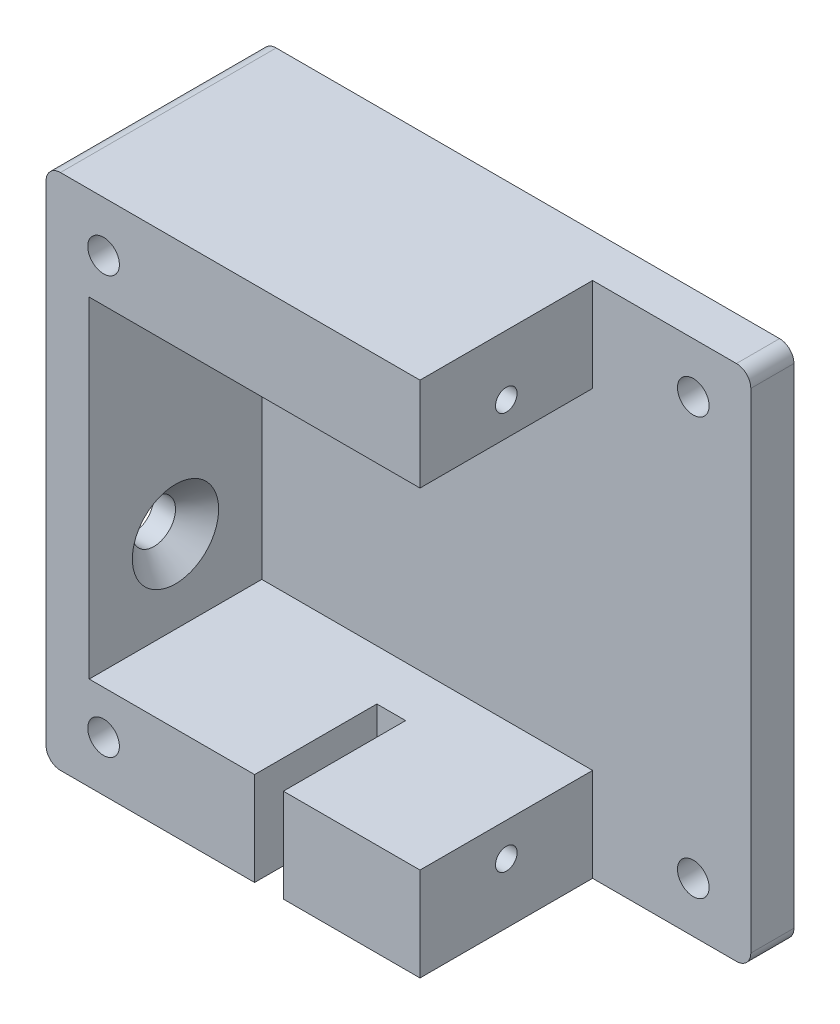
from build123d import *

# Parameters (mm, degrees)
SKETCH_1_W             = 37
SKETCH_1_H             = 36
EXTRUDE_397_DEPTH      = 3
EXTRUDE_691_DEPTH      = 12
SKETCH_4_R             = 1.5
CUT_EXTRUDE_986_DEPTH  = 42.291645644
CHAMFER_1_SIZE         = 1.5
SKETCH_3_R             = 0.75
CUT_EXTRUDE_1285_DEPTH = 10
CUT_EXTRUDE_1540_REACH = 45.165
SKETCH_5_W             = 2
SKETCH_5_H             = 8.5
SKETCH_6_R             = 1.1
CUT_EXTRUDE_1783_DEPTH = 30.853810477
FILLET_1_R             = 1


with BuildPart() as part:
    # Sketch 1 → Extrude 397 (new body)
    with BuildSketch(Plane.XY):
        Rectangle(SKETCH_1_W, SKETCH_1_H)
    extrude(amount=EXTRUDE_397_DEPTH)

    # Sketch 2 → Extrude 691 (add)
    with BuildSketch(Plane.XY.offset(3)):
        Polygon((7.5, 18), (-18.5, 18), (-18.5, -18), (7.5, -18), (7.5, -11.5), (-8.8, -11.5), (-15.5, -11.5), (-15.5, 11.5), (-8.8, 11.5), (7.5, 11.5), align=None)
    extrude(amount=EXTRUDE_691_DEPTH)

    # Sketch 4 → Cut-Extrude 986 (cut, through all)
    with BuildSketch(Plane(origin=(-15.5, 0, 0), x_dir=(0, 0, -1), z_dir=(1, 0, 0))):
        with Locations(Location((-9, -5.77, 0), (0, 0, 90))):
            Circle(SKETCH_4_R)
    extrude(amount=-CUT_EXTRUDE_986_DEPTH, mode=Mode.SUBTRACT)

    # Chamfer 1
    chamfer_1_edges = [part.edges().sort_by_distance(p)[0] for p in [
        (-15.5, -7.27, 9),
    ]]
    chamfer(chamfer_1_edges, length=CHAMFER_1_SIZE)

    # Sketch 3 → Cut-Extrude 1285 (cut)
    with BuildSketch(Plane(origin=(7.5, 0, 0), x_dir=(0, 0, -1), z_dir=(1, 0, 0))):
        with Locations((-9, 13.82)):
            Circle(SKETCH_3_R)
    cut_extrude_1285 = extrude(amount=-CUT_EXTRUDE_1285_DEPTH, mode=Mode.SUBTRACT)

    # Mirror 2: Cut-Extrude 1285 across plane
    add(cut_extrude_1285.mirror(Plane.ZX), mode=Mode.SUBTRACT)

    # Cut-Extrude 1540: up to this face of the body (flat: up to its plane)
    cut_extrude_1540_end = Plane(part.part.faces().sort_by_distance((-4, -11.5, 9))[0])
    # Sketch 5 → Cut-Extrude 1540 (cut, up to the picked face)
    with BuildSketch(Plane.XZ.offset(18), mode=Mode.PRIVATE) as cut_extrude_1540_sk1:
        with Locations((-3, 10.75)):
            Rectangle(SKETCH_5_W, SKETCH_5_H)
    cut_extrude_1540_tool1 = split(extrude(cut_extrude_1540_sk1.sketch, amount=-CUT_EXTRUDE_1540_REACH, mode=Mode.PRIVATE), bisect_by=cut_extrude_1540_end, keep=Keep.BOTH, mode=Mode.PRIVATE)
    add(cut_extrude_1540_tool1.solids().sort_by(Axis((-3, -18, 10.75), (0, 1, 0)))[0], mode=Mode.SUBTRACT)

    # Sketch 6 → Cut-Extrude 1783 (cut, through all)
    with BuildSketch(Plane(origin=(0, 0, 0), x_dir=(-1, 0, 0), z_dir=(0, 0, -1))):
        with Locations((-14.5, 14.5)):
            Circle(SKETCH_6_R)
        with Locations((14.5, 14.5)):
            Circle(SKETCH_6_R)
        with Locations((14.5, -14.5)):
            Circle(SKETCH_6_R)
        with Locations((-14.5, -14.5)):
            Circle(SKETCH_6_R)
    extrude(amount=-CUT_EXTRUDE_1783_DEPTH, mode=Mode.SUBTRACT)

    # Fillet 1
    fillet_1_edges = [part.edges().sort_by_distance(p)[0] for p in [
        (18.5, -18, 1.5),
        (-18.5, -18, 7.5),
        (-18.5, 18, 7.5),
        (18.5, 18, 1.5),
    ]]
    fillet(fillet_1_edges, radius=FILLET_1_R)


solid = part.part
